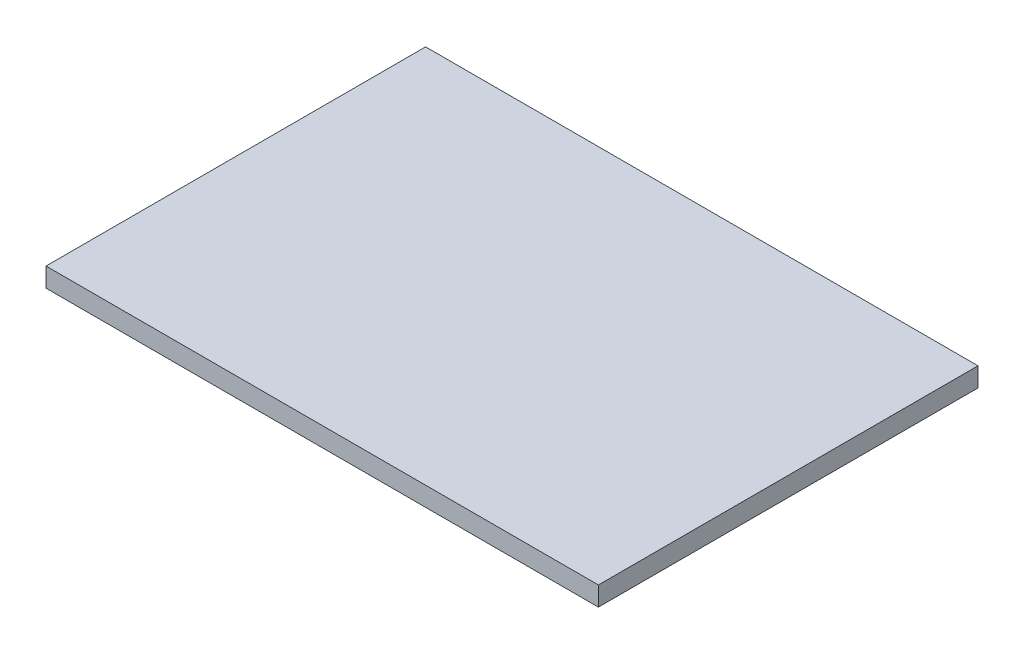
ISO-10303-21;
HEADER;
FILE_DESCRIPTION(('STEP AP214'),'2;1');
FILE_NAME('part.step','',(''),(''),'','','');
FILE_SCHEMA(('AUTOMOTIVE_DESIGN { 1 0 10303 214 1 1 1 1 }'));
ENDSEC;
DATA;
#1=APPLICATION_CONTEXT('core data for automotive mechanical design processes');
#2=APPLICATION_PROTOCOL_DEFINITION('international standard','automotive_design',2000,#1);
#3=PRODUCT_CONTEXT('',#1,'mechanical');
#4=PRODUCT('Part','Part','',(#3));
#5=PRODUCT_RELATED_PRODUCT_CATEGORY('part','',(#4));
#6=PRODUCT_DEFINITION_FORMATION('','',#4);
#7=PRODUCT_DEFINITION_CONTEXT('part definition',#1,'design');
#8=PRODUCT_DEFINITION('design','',#6,#7);
#9=PRODUCT_DEFINITION_SHAPE('','',#8);
#10=(LENGTH_UNIT() NAMED_UNIT(*) SI_UNIT(.MILLI.,.METRE.));
#11=(NAMED_UNIT(*) PLANE_ANGLE_UNIT() SI_UNIT($,.RADIAN.));
#12=(NAMED_UNIT(*) SI_UNIT($,.STERADIAN.) SOLID_ANGLE_UNIT());
#13=UNCERTAINTY_MEASURE_WITH_UNIT(LENGTH_MEASURE(1.E-05),#10,'distance_accuracy_value','');
#14=(GEOMETRIC_REPRESENTATION_CONTEXT(3) GLOBAL_UNCERTAINTY_ASSIGNED_CONTEXT((#13)) GLOBAL_UNIT_ASSIGNED_CONTEXT((#10,
#11,#12)) REPRESENTATION_CONTEXT('',''));
#15=CARTESIAN_POINT('',(0.,0.,0.));
#16=DIRECTION('',(0.,0.,1.));
#17=DIRECTION('',(1.,0.,0.));
#18=AXIS2_PLACEMENT_3D('',#15,#16,#17);
#19=CARTESIAN_POINT('',(0.,2.,0.));
#20=DIRECTION('',(1.,0.,0.));
#21=DIRECTION('',(0.,0.,-1.));
#22=AXIS2_PLACEMENT_3D('',#19,#20,#21);
#23=PLANE('',#22);
#24=DIRECTION('',(0.,0.,1.));
#25=VECTOR('',#24,1.);
#26=CARTESIAN_POINT('',(0.,0.,0.));
#27=LINE('',#26,#25);
#28=CARTESIAN_POINT('',(0.,0.,-39.52));
#29=VERTEX_POINT('',#28);
#30=CARTESIAN_POINT('',(0.,0.,0.));
#31=VERTEX_POINT('',#30);
#32=EDGE_CURVE('E96',#29,#31,#27,.T.);
#33=ORIENTED_EDGE('',*,*,#32,.T.);
#34=DIRECTION('',(0.,-1.,0.));
#35=VECTOR('',#34,1.);
#36=CARTESIAN_POINT('',(0.,2.,0.));
#37=LINE('',#36,#35);
#38=CARTESIAN_POINT('',(0.,2.,0.));
#39=VERTEX_POINT('',#38);
#40=EDGE_CURVE('E11',#39,#31,#37,.T.);
#41=ORIENTED_EDGE('',*,*,#40,.F.);
#42=DIRECTION('',(0.,0.,1.));
#43=VECTOR('',#42,1.);
#44=CARTESIAN_POINT('',(0.,2.,0.));
#45=LINE('',#44,#43);
#46=CARTESIAN_POINT('',(0.,2.,-39.52));
#47=VERTEX_POINT('',#46);
#48=EDGE_CURVE('E84',#47,#39,#45,.T.);
#49=ORIENTED_EDGE('',*,*,#48,.F.);
#50=DIRECTION('',(0.,-1.,0.));
#51=VECTOR('',#50,1.);
#52=CARTESIAN_POINT('',(0.,2.,-39.52));
#53=LINE('',#52,#51);
#54=EDGE_CURVE('E92',#47,#29,#53,.T.);
#55=ORIENTED_EDGE('',*,*,#54,.T.);
#56=EDGE_LOOP('',(#33,#41,#49,#55));
#57=FACE_BOUND('',#56,.T.);
#58=ADVANCED_FACE('F33',(#57),#23,.F.);
#59=CARTESIAN_POINT('',(0.,2.,0.));
#60=DIRECTION('',(0.,0.,-1.));
#61=DIRECTION('',(-1.,0.,0.));
#62=AXIS2_PLACEMENT_3D('',#59,#60,#61);
#63=PLANE('',#62);
#64=DIRECTION('',(1.,0.,0.));
#65=VECTOR('',#64,1.);
#66=CARTESIAN_POINT('',(0.,0.,0.));
#67=LINE('',#66,#65);
#68=CARTESIAN_POINT('',(57.51,0.,0.));
#69=VERTEX_POINT('',#68);
#70=EDGE_CURVE('E88',#31,#69,#67,.T.);
#71=ORIENTED_EDGE('',*,*,#70,.T.);
#72=DIRECTION('',(0.,-1.,0.));
#73=VECTOR('',#72,1.);
#74=CARTESIAN_POINT('',(57.51,2.,0.));
#75=LINE('',#74,#73);
#76=CARTESIAN_POINT('',(57.51,2.,0.));
#77=VERTEX_POINT('',#76);
#78=EDGE_CURVE('E41',#77,#69,#75,.T.);
#79=ORIENTED_EDGE('',*,*,#78,.F.);
#80=DIRECTION('',(1.,0.,0.));
#81=VECTOR('',#80,1.);
#82=CARTESIAN_POINT('',(0.,2.,0.));
#83=LINE('',#82,#81);
#84=EDGE_CURVE('E79',#39,#77,#83,.T.);
#85=ORIENTED_EDGE('',*,*,#84,.F.);
#86=ORIENTED_EDGE('',*,*,#40,.T.);
#87=EDGE_LOOP('',(#71,#79,#85,#86));
#88=FACE_BOUND('',#87,.T.);
#89=ADVANCED_FACE('F87',(#88),#63,.F.);
#90=CARTESIAN_POINT('',(57.51,2.,0.));
#91=DIRECTION('',(-1.,0.,0.));
#92=DIRECTION('',(0.,0.,1.));
#93=AXIS2_PLACEMENT_3D('',#90,#91,#92);
#94=PLANE('',#93);
#95=DIRECTION('',(0.,0.,-1.));
#96=VECTOR('',#95,1.);
#97=CARTESIAN_POINT('',(57.51,0.,0.));
#98=LINE('',#97,#96);
#99=CARTESIAN_POINT('',(57.51,0.,-39.52));
#100=VERTEX_POINT('',#99);
#101=EDGE_CURVE('E66',#69,#100,#98,.T.);
#102=ORIENTED_EDGE('',*,*,#101,.T.);
#103=DIRECTION('',(0.,-1.,0.));
#104=VECTOR('',#103,1.);
#105=CARTESIAN_POINT('',(57.51,2.,-39.52));
#106=LINE('',#105,#104);
#107=CARTESIAN_POINT('',(57.51,2.,-39.52));
#108=VERTEX_POINT('',#107);
#109=EDGE_CURVE('E89',#108,#100,#106,.T.);
#110=ORIENTED_EDGE('',*,*,#109,.F.);
#111=DIRECTION('',(0.,0.,-1.));
#112=VECTOR('',#111,1.);
#113=CARTESIAN_POINT('',(57.51,2.,0.));
#114=LINE('',#113,#112);
#115=EDGE_CURVE('E82',#77,#108,#114,.T.);
#116=ORIENTED_EDGE('',*,*,#115,.F.);
#117=ORIENTED_EDGE('',*,*,#78,.T.);
#118=EDGE_LOOP('',(#102,#110,#116,#117));
#119=FACE_BOUND('',#118,.T.);
#120=ADVANCED_FACE('F90',(#119),#94,.F.);
#121=CARTESIAN_POINT('',(0.,2.,-39.52));
#122=DIRECTION('',(0.,0.,1.));
#123=DIRECTION('',(1.,0.,0.));
#124=AXIS2_PLACEMENT_3D('',#121,#122,#123);
#125=PLANE('',#124);
#126=DIRECTION('',(-1.,0.,0.));
#127=VECTOR('',#126,1.);
#128=CARTESIAN_POINT('',(0.,0.,-39.52));
#129=LINE('',#128,#127);
#130=EDGE_CURVE('E72',#100,#29,#129,.T.);
#131=ORIENTED_EDGE('',*,*,#130,.T.);
#132=ORIENTED_EDGE('',*,*,#54,.F.);
#133=DIRECTION('',(-1.,0.,0.));
#134=VECTOR('',#133,1.);
#135=CARTESIAN_POINT('',(0.,2.,-39.52));
#136=LINE('',#135,#134);
#137=EDGE_CURVE('E49',#108,#47,#136,.T.);
#138=ORIENTED_EDGE('',*,*,#137,.F.);
#139=ORIENTED_EDGE('',*,*,#109,.T.);
#140=EDGE_LOOP('',(#131,#132,#138,#139));
#141=FACE_BOUND('',#140,.T.);
#142=ADVANCED_FACE('F103',(#141),#125,.F.);
#143=CARTESIAN_POINT('',(0.,2.,0.));
#144=DIRECTION('',(0.,-1.,0.));
#145=DIRECTION('',(0.,0.,-1.));
#146=AXIS2_PLACEMENT_3D('',#143,#144,#145);
#147=PLANE('',#146);
#148=ORIENTED_EDGE('',*,*,#48,.T.);
#149=ORIENTED_EDGE('',*,*,#84,.T.);
#150=ORIENTED_EDGE('',*,*,#115,.T.);
#151=ORIENTED_EDGE('',*,*,#137,.T.);
#152=EDGE_LOOP('',(#148,#149,#150,#151));
#153=FACE_BOUND('',#152,.T.);
#154=ADVANCED_FACE('F80',(#153),#147,.F.);
#155=CARTESIAN_POINT('',(0.,0.,0.));
#156=DIRECTION('',(0.,-1.,0.));
#157=DIRECTION('',(0.,0.,-1.));
#158=AXIS2_PLACEMENT_3D('',#155,#156,#157);
#159=PLANE('',#158);
#160=ORIENTED_EDGE('',*,*,#32,.F.);
#161=ORIENTED_EDGE('',*,*,#130,.F.);
#162=ORIENTED_EDGE('',*,*,#101,.F.);
#163=ORIENTED_EDGE('',*,*,#70,.F.);
#164=EDGE_LOOP('',(#160,#161,#162,#163));
#165=FACE_BOUND('',#164,.T.);
#166=ADVANCED_FACE('F106',(#165),#159,.T.);
#167=CLOSED_SHELL('',(#58,#89,#120,#142,#154,#166));
#168=MANIFOLD_SOLID_BREP('B2',#167);
#169=ADVANCED_BREP_SHAPE_REPRESENTATION('',(#18,#168),#14);
#170=SHAPE_DEFINITION_REPRESENTATION(#9,#169);
ENDSEC;
END-ISO-10303-21;
